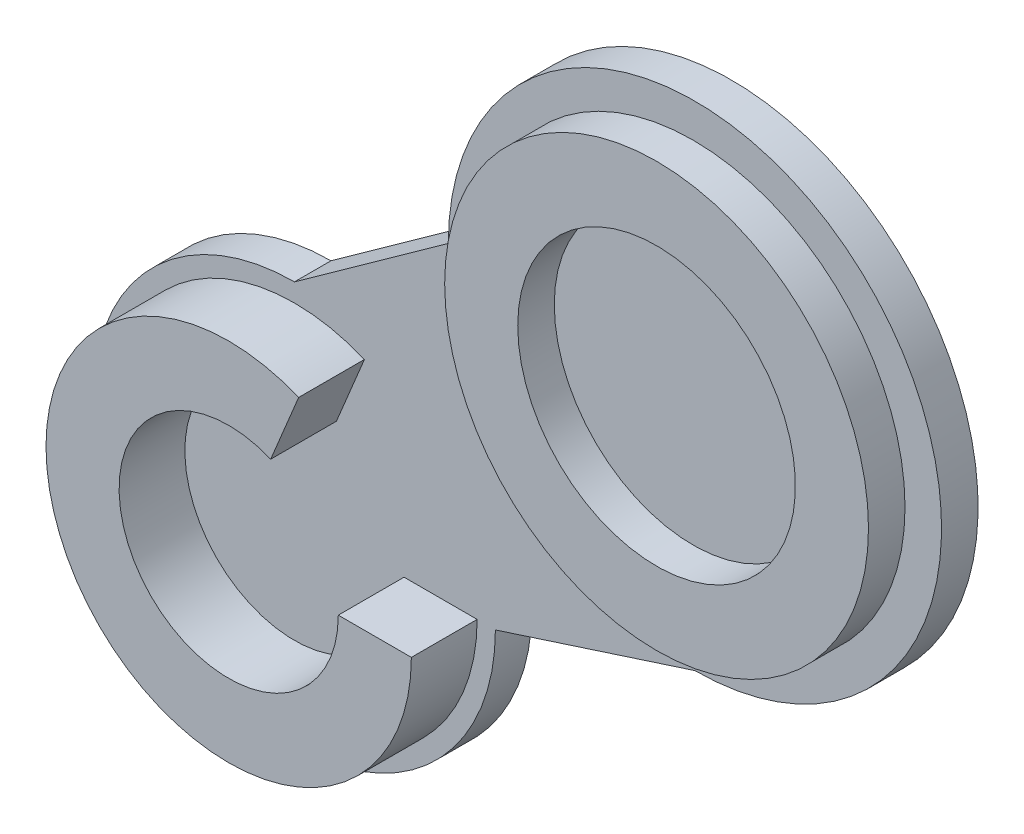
ISO-10303-21;
HEADER;
FILE_DESCRIPTION(('STEP AP214'),'2;1');
FILE_NAME('part.step','',(''),(''),'','','');
FILE_SCHEMA(('AUTOMOTIVE_DESIGN { 1 0 10303 214 1 1 1 1 }'));
ENDSEC;
DATA;
#1=APPLICATION_CONTEXT('core data for automotive mechanical design processes');
#2=APPLICATION_PROTOCOL_DEFINITION('international standard','automotive_design',2000,#1);
#3=PRODUCT_CONTEXT('',#1,'mechanical');
#4=PRODUCT('Part','Part','',(#3));
#5=PRODUCT_RELATED_PRODUCT_CATEGORY('part','',(#4));
#6=PRODUCT_DEFINITION_FORMATION('','',#4);
#7=PRODUCT_DEFINITION_CONTEXT('part definition',#1,'design');
#8=PRODUCT_DEFINITION('design','',#6,#7);
#9=PRODUCT_DEFINITION_SHAPE('','',#8);
#10=(LENGTH_UNIT() NAMED_UNIT(*) SI_UNIT(.MILLI.,.METRE.));
#11=(NAMED_UNIT(*) PLANE_ANGLE_UNIT() SI_UNIT($,.RADIAN.));
#12=(NAMED_UNIT(*) SI_UNIT($,.STERADIAN.) SOLID_ANGLE_UNIT());
#13=UNCERTAINTY_MEASURE_WITH_UNIT(LENGTH_MEASURE(1.E-05),#10,'distance_accuracy_value','');
#14=(GEOMETRIC_REPRESENTATION_CONTEXT(3) GLOBAL_UNCERTAINTY_ASSIGNED_CONTEXT((#13)) GLOBAL_UNIT_ASSIGNED_CONTEXT((#10,
#11,#12)) REPRESENTATION_CONTEXT('',''));
#15=CARTESIAN_POINT('',(0.,0.,0.));
#16=DIRECTION('',(0.,0.,1.));
#17=DIRECTION('',(1.,0.,0.));
#18=AXIS2_PLACEMENT_3D('',#15,#16,#17);
#19=CARTESIAN_POINT('',(10.9609991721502,8.51559860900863,-1.));
#20=DIRECTION('',(0.,0.,1.));
#21=DIRECTION('',(1.,0.,0.));
#22=AXIS2_PLACEMENT_3D('',#19,#20,#21);
#23=CYLINDRICAL_SURFACE('',#22,6.75);
#24=CARTESIAN_POINT('',(10.9609991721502,8.51559860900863,0.));
#25=DIRECTION('',(0.,0.,-1.));
#26=DIRECTION('',(-1.,0.,0.));
#27=AXIS2_PLACEMENT_3D('',#24,#25,#26);
#28=CIRCLE('',#27,6.75);
#29=CARTESIAN_POINT('',(4.21099917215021,8.51559860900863,0.));
#30=VERTEX_POINT('',#29);
#31=CARTESIAN_POINT('',(10.9609991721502,1.76559860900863,0.));
#32=VERTEX_POINT('',#31);
#33=EDGE_CURVE('E126',#30,#32,#28,.T.);
#34=ORIENTED_EDGE('',*,*,#33,.T.);
#35=DIRECTION('',(0.,0.,1.));
#36=VECTOR('',#35,1.);
#37=CARTESIAN_POINT('',(10.9609991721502,1.76559860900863,-1.));
#38=LINE('',#37,#36);
#39=CARTESIAN_POINT('',(10.9609991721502,1.76559860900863,-1.));
#40=VERTEX_POINT('',#39);
#41=EDGE_CURVE('E58',#40,#32,#38,.T.);
#42=ORIENTED_EDGE('',*,*,#41,.F.);
#43=CARTESIAN_POINT('',(10.9609991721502,8.51559860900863,-1.));
#44=DIRECTION('',(0.,0.,-1.));
#45=DIRECTION('',(-1.,0.,0.));
#46=AXIS2_PLACEMENT_3D('',#43,#44,#45);
#47=CIRCLE('',#46,6.75);
#48=CARTESIAN_POINT('',(4.21099917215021,8.51559860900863,-1.));
#49=VERTEX_POINT('',#48);
#50=EDGE_CURVE('E109',#49,#40,#47,.T.);
#51=ORIENTED_EDGE('',*,*,#50,.F.);
#52=DIRECTION('',(0.,0.,1.));
#53=VECTOR('',#52,1.);
#54=CARTESIAN_POINT('',(4.21099917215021,8.51559860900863,-1.));
#55=LINE('',#54,#53);
#56=EDGE_CURVE('E122',#49,#30,#55,.T.);
#57=ORIENTED_EDGE('',*,*,#56,.T.);
#58=EDGE_LOOP('',(#34,#42,#51,#57));
#59=FACE_BOUND('',#58,.T.);
#60=ADVANCED_FACE('F55',(#59),#23,.T.);
#61=CARTESIAN_POINT('',(10.9609991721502,1.76559860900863,-1.));
#62=DIRECTION('',(-0.307631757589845,0.951505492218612,0.));
#63=DIRECTION('',(-0.951505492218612,-0.307631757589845,0.));
#64=AXIS2_PLACEMENT_3D('',#61,#62,#63);
#65=PLANE('',#64);
#66=DIRECTION('',(-0.951505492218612,-0.307631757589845,0.));
#67=VECTOR('',#66,1.);
#68=CARTESIAN_POINT('',(10.9609991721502,1.76559860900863,0.));
#69=LINE('',#68,#67);
#70=CARTESIAN_POINT('',(5.5,0.,0.));
#71=VERTEX_POINT('',#70);
#72=EDGE_CURVE('E115',#32,#71,#69,.T.);
#73=ORIENTED_EDGE('',*,*,#72,.T.);
#74=DIRECTION('',(0.,0.,1.));
#75=VECTOR('',#74,1.);
#76=CARTESIAN_POINT('',(5.5,0.,-1.));
#77=LINE('',#76,#75);
#78=CARTESIAN_POINT('',(5.5,0.,-1.));
#79=VERTEX_POINT('',#78);
#80=EDGE_CURVE('E113',#79,#71,#77,.T.);
#81=ORIENTED_EDGE('',*,*,#80,.F.);
#82=DIRECTION('',(-0.951505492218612,-0.307631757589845,0.));
#83=VECTOR('',#82,1.);
#84=CARTESIAN_POINT('',(10.9609991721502,1.76559860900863,-1.));
#85=LINE('',#84,#83);
#86=EDGE_CURVE('E104',#40,#79,#85,.T.);
#87=ORIENTED_EDGE('',*,*,#86,.F.);
#88=ORIENTED_EDGE('',*,*,#41,.T.);
#89=EDGE_LOOP('',(#73,#81,#87,#88));
#90=FACE_BOUND('',#89,.T.);
#91=ADVANCED_FACE('F114',(#90),#65,.F.);
#92=CARTESIAN_POINT('',(0.,0.,-1.));
#93=DIRECTION('',(0.,0.,1.));
#94=DIRECTION('',(1.,0.,0.));
#95=AXIS2_PLACEMENT_3D('',#92,#93,#94);
#96=CYLINDRICAL_SURFACE('',#95,5.5);
#97=CARTESIAN_POINT('',(0.,0.,0.));
#98=DIRECTION('',(0.,0.,-1.));
#99=DIRECTION('',(-1.,0.,0.));
#100=AXIS2_PLACEMENT_3D('',#97,#98,#99);
#101=CIRCLE('',#100,5.5);
#102=CARTESIAN_POINT('',(0.,5.5,0.));
#103=VERTEX_POINT('',#102);
#104=EDGE_CURVE('E90',#71,#103,#101,.T.);
#105=ORIENTED_EDGE('',*,*,#104,.T.);
#106=DIRECTION('',(0.,0.,1.));
#107=VECTOR('',#106,1.);
#108=CARTESIAN_POINT('',(0.,5.5,-1.));
#109=LINE('',#108,#107);
#110=CARTESIAN_POINT('',(0.,5.5,-1.));
#111=VERTEX_POINT('',#110);
#112=EDGE_CURVE('E117',#111,#103,#109,.T.);
#113=ORIENTED_EDGE('',*,*,#112,.F.);
#114=CARTESIAN_POINT('',(0.,0.,-1.));
#115=DIRECTION('',(0.,0.,-1.));
#116=DIRECTION('',(-1.,0.,0.));
#117=AXIS2_PLACEMENT_3D('',#114,#115,#116);
#118=CIRCLE('',#117,5.5);
#119=EDGE_CURVE('E107',#79,#111,#118,.T.);
#120=ORIENTED_EDGE('',*,*,#119,.F.);
#121=ORIENTED_EDGE('',*,*,#80,.T.);
#122=EDGE_LOOP('',(#105,#113,#120,#121));
#123=FACE_BOUND('',#122,.T.);
#124=ADVANCED_FACE('F118',(#123),#96,.T.);
#125=CARTESIAN_POINT('',(4.21099917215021,8.51559860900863,-1.));
#126=DIRECTION('',(0.582227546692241,-0.813025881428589,0.));
#127=DIRECTION('',(0.813025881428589,0.582227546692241,0.));
#128=AXIS2_PLACEMENT_3D('',#125,#126,#127);
#129=PLANE('',#128);
#130=DIRECTION('',(0.813025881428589,0.582227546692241,0.));
#131=VECTOR('',#130,1.);
#132=CARTESIAN_POINT('',(4.21099917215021,8.51559860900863,0.));
#133=LINE('',#132,#131);
#134=EDGE_CURVE('E96',#103,#30,#133,.T.);
#135=ORIENTED_EDGE('',*,*,#134,.T.);
#136=ORIENTED_EDGE('',*,*,#56,.F.);
#137=DIRECTION('',(0.813025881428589,0.582227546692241,0.));
#138=VECTOR('',#137,1.);
#139=CARTESIAN_POINT('',(4.21099917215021,8.51559860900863,-1.));
#140=LINE('',#139,#138);
#141=EDGE_CURVE('E73',#111,#49,#140,.T.);
#142=ORIENTED_EDGE('',*,*,#141,.F.);
#143=ORIENTED_EDGE('',*,*,#112,.T.);
#144=EDGE_LOOP('',(#135,#136,#142,#143));
#145=FACE_BOUND('',#144,.T.);
#146=ADVANCED_FACE('F140',(#145),#129,.F.);
#147=CARTESIAN_POINT('',(10.9609991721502,8.51559860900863,-1.));
#148=DIRECTION('',(0.,0.,-1.));
#149=DIRECTION('',(-1.,0.,0.));
#150=AXIS2_PLACEMENT_3D('',#147,#148,#149);
#151=PLANE('',#150);
#152=ORIENTED_EDGE('',*,*,#50,.T.);
#153=ORIENTED_EDGE('',*,*,#86,.T.);
#154=ORIENTED_EDGE('',*,*,#119,.T.);
#155=ORIENTED_EDGE('',*,*,#141,.T.);
#156=EDGE_LOOP('',(#152,#153,#154,#155));
#157=FACE_BOUND('',#156,.T.);
#158=ADVANCED_FACE('F105',(#157),#151,.T.);
#159=CARTESIAN_POINT('',(10.9609991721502,8.51559860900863,0.));
#160=DIRECTION('',(0.,0.,-1.));
#161=DIRECTION('',(-1.,0.,0.));
#162=AXIS2_PLACEMENT_3D('',#159,#160,#161);
#163=PLANE('',#162);
#164=CARTESIAN_POINT('',(10.9109991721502,8.51559860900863,0.));
#165=DIRECTION('',(0.,0.,-1.));
#166=DIRECTION('',(-1.,0.,0.));
#167=AXIS2_PLACEMENT_3D('',#164,#165,#166);
#168=CIRCLE('',#167,5.8);
#169=CARTESIAN_POINT('',(5.11099917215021,8.51559860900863,0.));
#170=VERTEX_POINT('',#169);
#171=EDGE_CURVE('E147',#170,#170,#168,.T.);
#172=ORIENTED_EDGE('',*,*,#171,.T.);
#173=EDGE_LOOP('',(#172));
#174=FACE_BOUND('',#173,.T.);
#175=ORIENTED_EDGE('',*,*,#33,.F.);
#176=ORIENTED_EDGE('',*,*,#134,.F.);
#177=ORIENTED_EDGE('',*,*,#104,.F.);
#178=ORIENTED_EDGE('',*,*,#72,.F.);
#179=EDGE_LOOP('',(#175,#176,#177,#178));
#180=FACE_BOUND('',#179,.T.);
#181=ADVANCED_FACE('F143',(#174,#180),#163,.F.);
#182=CARTESIAN_POINT('',(10.9109991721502,8.51559860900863,1.));
#183=DIRECTION('',(0.,0.,-1.));
#184=DIRECTION('',(-1.,0.,0.));
#185=AXIS2_PLACEMENT_3D('',#182,#183,#184);
#186=CYLINDRICAL_SURFACE('',#185,5.8);
#187=CARTESIAN_POINT('',(10.9109991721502,8.51559860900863,1.));
#188=DIRECTION('',(0.,0.,-1.));
#189=DIRECTION('',(-1.,0.,0.));
#190=AXIS2_PLACEMENT_3D('',#187,#188,#189);
#191=CIRCLE('',#190,5.8);
#192=CARTESIAN_POINT('',(5.11099917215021,8.51559860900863,1.));
#193=VERTEX_POINT('',#192);
#194=EDGE_CURVE('E130',#193,#193,#191,.T.);
#195=ORIENTED_EDGE('',*,*,#194,.T.);
#196=EDGE_LOOP('',(#195));
#197=FACE_BOUND('',#196,.T.);
#198=ORIENTED_EDGE('',*,*,#171,.F.);
#199=EDGE_LOOP('',(#198));
#200=FACE_BOUND('',#199,.T.);
#201=ADVANCED_FACE('F176',(#197,#200),#186,.T.);
#202=CARTESIAN_POINT('',(10.9109991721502,8.51559860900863,1.));
#203=DIRECTION('',(0.,0.,-1.));
#204=DIRECTION('',(-1.,0.,0.));
#205=AXIS2_PLACEMENT_3D('',#202,#203,#204);
#206=PLANE('',#205);
#207=CARTESIAN_POINT('',(10.9109991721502,8.51559860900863,1.));
#208=DIRECTION('',(0.,0.,-1.));
#209=DIRECTION('',(-1.,0.,0.));
#210=AXIS2_PLACEMENT_3D('',#207,#208,#209);
#211=CIRCLE('',#210,3.8);
#212=CARTESIAN_POINT('',(7.11099917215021,8.51559860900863,1.));
#213=VERTEX_POINT('',#212);
#214=EDGE_CURVE('E151',#213,#213,#211,.T.);
#215=ORIENTED_EDGE('',*,*,#214,.T.);
#216=EDGE_LOOP('',(#215));
#217=FACE_BOUND('',#216,.T.);
#218=ORIENTED_EDGE('',*,*,#194,.F.);
#219=EDGE_LOOP('',(#218));
#220=FACE_BOUND('',#219,.T.);
#221=ADVANCED_FACE('F159',(#217,#220),#206,.F.);
#222=CARTESIAN_POINT('',(10.9109991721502,8.51559860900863,1.));
#223=DIRECTION('',(0.,0.,-1.));
#224=DIRECTION('',(-1.,0.,0.));
#225=AXIS2_PLACEMENT_3D('',#222,#223,#224);
#226=CYLINDRICAL_SURFACE('',#225,3.8);
#227=ORIENTED_EDGE('',*,*,#214,.F.);
#228=EDGE_LOOP('',(#227));
#229=FACE_BOUND('',#228,.T.);
#230=CARTESIAN_POINT('',(10.9109991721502,8.51559860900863,0.));
#231=DIRECTION('',(0.,0.,-1.));
#232=DIRECTION('',(-1.,0.,0.));
#233=AXIS2_PLACEMENT_3D('',#230,#231,#232);
#234=CIRCLE('',#233,3.8);
#235=CARTESIAN_POINT('',(7.11099917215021,8.51559860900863,0.));
#236=VERTEX_POINT('',#235);
#237=EDGE_CURVE('E12',#236,#236,#234,.T.);
#238=ORIENTED_EDGE('',*,*,#237,.T.);
#239=EDGE_LOOP('',(#238));
#240=FACE_BOUND('',#239,.T.);
#241=ADVANCED_FACE('F162',(#229,#240),#226,.F.);
#242=ORIENTED_EDGE('',*,*,#237,.F.);
#243=EDGE_LOOP('',(#242));
#244=FACE_BOUND('',#243,.T.);
#245=ADVANCED_FACE('F165',(#244),#163,.F.);
#246=CLOSED_SHELL('',(#60,#91,#124,#146,#158,#181,#201,#221,#241,#245));
#247=MANIFOLD_SOLID_BREP('B2',#246);
#248=CARTESIAN_POINT('',(0.,0.,1.8));
#249=DIRECTION('',(0.,0.,-1.));
#250=DIRECTION('',(-1.,0.,0.));
#251=AXIS2_PLACEMENT_3D('',#248,#249,#250);
#252=CYLINDRICAL_SURFACE('',#251,5.);
#253=CARTESIAN_POINT('',(0.,0.,0.));
#254=DIRECTION('',(0.,0.,1.));
#255=DIRECTION('',(1.,0.,0.));
#256=AXIS2_PLACEMENT_3D('',#253,#254,#255);
#257=CIRCLE('',#256,5.);
#258=CARTESIAN_POINT('',(1.91527555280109,4.61862745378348,0.));
#259=VERTEX_POINT('',#258);
#260=CARTESIAN_POINT('',(5.,0.,0.));
#261=VERTEX_POINT('',#260);
#262=EDGE_CURVE('E317',#259,#261,#257,.T.);
#263=ORIENTED_EDGE('',*,*,#262,.T.);
#264=DIRECTION('',(0.,0.,-1.));
#265=VECTOR('',#264,1.);
#266=CARTESIAN_POINT('',(5.,0.,1.8));
#267=LINE('',#266,#265);
#268=CARTESIAN_POINT('',(5.,0.,1.8));
#269=VERTEX_POINT('',#268);
#270=EDGE_CURVE('E53',#269,#261,#267,.T.);
#271=ORIENTED_EDGE('',*,*,#270,.F.);
#272=CARTESIAN_POINT('',(0.,0.,1.8));
#273=DIRECTION('',(0.,0.,1.));
#274=DIRECTION('',(1.,0.,0.));
#275=AXIS2_PLACEMENT_3D('',#272,#273,#274);
#276=CIRCLE('',#275,5.);
#277=CARTESIAN_POINT('',(1.91527555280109,4.61862745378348,1.8));
#278=VERTEX_POINT('',#277);
#279=EDGE_CURVE('E305',#278,#269,#276,.T.);
#280=ORIENTED_EDGE('',*,*,#279,.F.);
#281=DIRECTION('',(0.,0.,-1.));
#282=VECTOR('',#281,1.);
#283=CARTESIAN_POINT('',(1.91527555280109,4.61862745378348,1.8));
#284=LINE('',#283,#282);
#285=EDGE_CURVE('E313',#278,#259,#284,.T.);
#286=ORIENTED_EDGE('',*,*,#285,.T.);
#287=EDGE_LOOP('',(#263,#271,#280,#286));
#288=FACE_BOUND('',#287,.T.);
#289=ADVANCED_FACE('F254',(#288),#252,.T.);
#290=CARTESIAN_POINT('',(3.,0.,1.8));
#291=DIRECTION('',(0.,-1.,0.));
#292=DIRECTION('',(0.,0.,-1.));
#293=AXIS2_PLACEMENT_3D('',#290,#291,#292);
#294=PLANE('',#293);
#295=DIRECTION('',(-1.,0.,0.));
#296=VECTOR('',#295,1.);
#297=CARTESIAN_POINT('',(3.,0.,0.));
#298=LINE('',#297,#296);
#299=CARTESIAN_POINT('',(3.,0.,0.));
#300=VERTEX_POINT('',#299);
#301=EDGE_CURVE('E309',#261,#300,#298,.T.);
#302=ORIENTED_EDGE('',*,*,#301,.T.);
#303=DIRECTION('',(0.,0.,-1.));
#304=VECTOR('',#303,1.);
#305=CARTESIAN_POINT('',(3.,0.,1.8));
#306=LINE('',#305,#304);
#307=CARTESIAN_POINT('',(3.,0.,1.8));
#308=VERTEX_POINT('',#307);
#309=EDGE_CURVE('E262',#308,#300,#306,.T.);
#310=ORIENTED_EDGE('',*,*,#309,.F.);
#311=DIRECTION('',(-1.,0.,0.));
#312=VECTOR('',#311,1.);
#313=CARTESIAN_POINT('',(3.,0.,1.8));
#314=LINE('',#313,#312);
#315=EDGE_CURVE('E300',#269,#308,#314,.T.);
#316=ORIENTED_EDGE('',*,*,#315,.F.);
#317=ORIENTED_EDGE('',*,*,#270,.T.);
#318=EDGE_LOOP('',(#302,#310,#316,#317));
#319=FACE_BOUND('',#318,.T.);
#320=ADVANCED_FACE('F308',(#319),#294,.F.);
#321=CARTESIAN_POINT('',(0.,0.,1.8));
#322=DIRECTION('',(0.,0.,-1.));
#323=DIRECTION('',(-1.,0.,0.));
#324=AXIS2_PLACEMENT_3D('',#321,#322,#323);
#325=CYLINDRICAL_SURFACE('',#324,3.);
#326=CARTESIAN_POINT('',(0.,0.,0.));
#327=DIRECTION('',(0.,0.,-1.));
#328=DIRECTION('',(1.,0.,0.));
#329=AXIS2_PLACEMENT_3D('',#326,#327,#328);
#330=CIRCLE('',#329,3.);
#331=CARTESIAN_POINT('',(1.14916533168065,2.77117647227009,0.));
#332=VERTEX_POINT('',#331);
#333=EDGE_CURVE('E287',#300,#332,#330,.T.);
#334=ORIENTED_EDGE('',*,*,#333,.T.);
#335=DIRECTION('',(0.,0.,-1.));
#336=VECTOR('',#335,1.);
#337=CARTESIAN_POINT('',(1.14916533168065,2.77117647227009,1.8));
#338=LINE('',#337,#336);
#339=CARTESIAN_POINT('',(1.14916533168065,2.77117647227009,1.8));
#340=VERTEX_POINT('',#339);
#341=EDGE_CURVE('E310',#340,#332,#338,.T.);
#342=ORIENTED_EDGE('',*,*,#341,.F.);
#343=CARTESIAN_POINT('',(0.,0.,1.8));
#344=DIRECTION('',(0.,0.,-1.));
#345=DIRECTION('',(1.,0.,0.));
#346=AXIS2_PLACEMENT_3D('',#343,#344,#345);
#347=CIRCLE('',#346,3.);
#348=EDGE_CURVE('E303',#308,#340,#347,.T.);
#349=ORIENTED_EDGE('',*,*,#348,.F.);
#350=ORIENTED_EDGE('',*,*,#309,.T.);
#351=EDGE_LOOP('',(#334,#342,#349,#350));
#352=FACE_BOUND('',#351,.T.);
#353=ADVANCED_FACE('F311',(#352),#325,.F.);
#354=CARTESIAN_POINT('',(1.14916533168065,2.77117647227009,1.8));
#355=DIRECTION('',(-0.923725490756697,0.383055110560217,0.));
#356=DIRECTION('',(-0.383055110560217,-0.923725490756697,0.));
#357=AXIS2_PLACEMENT_3D('',#354,#355,#356);
#358=PLANE('',#357);
#359=DIRECTION('',(0.383055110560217,0.923725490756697,0.));
#360=VECTOR('',#359,1.);
#361=CARTESIAN_POINT('',(1.14916533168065,2.77117647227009,0.));
#362=LINE('',#361,#360);
#363=EDGE_CURVE('E293',#332,#259,#362,.T.);
#364=ORIENTED_EDGE('',*,*,#363,.T.);
#365=ORIENTED_EDGE('',*,*,#285,.F.);
#366=DIRECTION('',(0.383055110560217,0.923725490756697,0.));
#367=VECTOR('',#366,1.);
#368=CARTESIAN_POINT('',(1.14916533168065,2.77117647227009,1.8));
#369=LINE('',#368,#367);
#370=EDGE_CURVE('E270',#340,#278,#369,.T.);
#371=ORIENTED_EDGE('',*,*,#370,.F.);
#372=ORIENTED_EDGE('',*,*,#341,.T.);
#373=EDGE_LOOP('',(#364,#365,#371,#372));
#374=FACE_BOUND('',#373,.T.);
#375=ADVANCED_FACE('F324',(#374),#358,.F.);
#376=CARTESIAN_POINT('',(0.,0.,1.8));
#377=DIRECTION('',(0.,0.,1.));
#378=DIRECTION('',(1.,0.,0.));
#379=AXIS2_PLACEMENT_3D('',#376,#377,#378);
#380=PLANE('',#379);
#381=ORIENTED_EDGE('',*,*,#279,.T.);
#382=ORIENTED_EDGE('',*,*,#315,.T.);
#383=ORIENTED_EDGE('',*,*,#348,.T.);
#384=ORIENTED_EDGE('',*,*,#370,.T.);
#385=EDGE_LOOP('',(#381,#382,#383,#384));
#386=FACE_BOUND('',#385,.T.);
#387=ADVANCED_FACE('F301',(#386),#380,.T.);
#388=CARTESIAN_POINT('',(0.,0.,0.));
#389=DIRECTION('',(0.,0.,1.));
#390=DIRECTION('',(1.,0.,0.));
#391=AXIS2_PLACEMENT_3D('',#388,#389,#390);
#392=PLANE('',#391);
#393=ORIENTED_EDGE('',*,*,#262,.F.);
#394=ORIENTED_EDGE('',*,*,#363,.F.);
#395=ORIENTED_EDGE('',*,*,#333,.F.);
#396=ORIENTED_EDGE('',*,*,#301,.F.);
#397=EDGE_LOOP('',(#393,#394,#395,#396));
#398=FACE_BOUND('',#397,.T.);
#399=ADVANCED_FACE('F327',(#398),#392,.F.);
#400=CLOSED_SHELL('',(#289,#320,#353,#375,#387,#399));
#401=MANIFOLD_SOLID_BREP('B6',#400);
#402=ADVANCED_BREP_SHAPE_REPRESENTATION('',(#18,#247,#401),#14);
#403=SHAPE_DEFINITION_REPRESENTATION(#9,#402);
ENDSEC;
END-ISO-10303-21;
